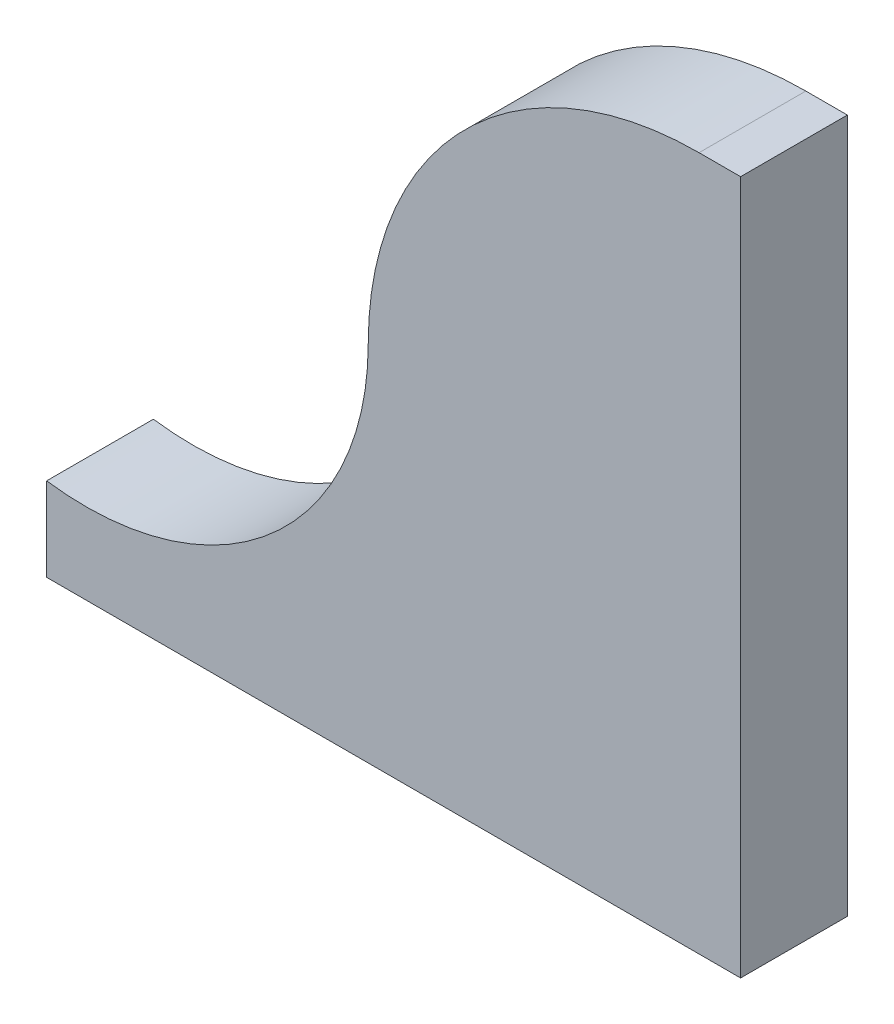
ISO-10303-21;
HEADER;
FILE_DESCRIPTION(('STEP AP214'),'2;1');
FILE_NAME('part.step','',(''),(''),'','','');
FILE_SCHEMA(('AUTOMOTIVE_DESIGN { 1 0 10303 214 1 1 1 1 }'));
ENDSEC;
DATA;
#1=APPLICATION_CONTEXT('core data for automotive mechanical design processes');
#2=APPLICATION_PROTOCOL_DEFINITION('international standard','automotive_design',2000,#1);
#3=PRODUCT_CONTEXT('',#1,'mechanical');
#4=PRODUCT('Part','Part','',(#3));
#5=PRODUCT_RELATED_PRODUCT_CATEGORY('part','',(#4));
#6=PRODUCT_DEFINITION_FORMATION('','',#4);
#7=PRODUCT_DEFINITION_CONTEXT('part definition',#1,'design');
#8=PRODUCT_DEFINITION('design','',#6,#7);
#9=PRODUCT_DEFINITION_SHAPE('','',#8);
#10=(LENGTH_UNIT() NAMED_UNIT(*) SI_UNIT(.MILLI.,.METRE.));
#11=(NAMED_UNIT(*) PLANE_ANGLE_UNIT() SI_UNIT($,.RADIAN.));
#12=(NAMED_UNIT(*) SI_UNIT($,.STERADIAN.) SOLID_ANGLE_UNIT());
#13=UNCERTAINTY_MEASURE_WITH_UNIT(LENGTH_MEASURE(1.E-05),#10,'distance_accuracy_value','');
#14=(GEOMETRIC_REPRESENTATION_CONTEXT(3) GLOBAL_UNCERTAINTY_ASSIGNED_CONTEXT((#13)) GLOBAL_UNIT_ASSIGNED_CONTEXT((#10,
#11,#12)) REPRESENTATION_CONTEXT('',''));
#15=CARTESIAN_POINT('',(0.,0.,0.));
#16=DIRECTION('',(0.,0.,1.));
#17=DIRECTION('',(1.,0.,0.));
#18=AXIS2_PLACEMENT_3D('',#15,#16,#17);
#19=CARTESIAN_POINT('',(-65.,0.,10.));
#20=DIRECTION('',(1.,0.,0.));
#21=DIRECTION('',(0.,0.,-1.));
#22=AXIS2_PLACEMENT_3D('',#19,#20,#21);
#23=PLANE('',#22);
#24=DIRECTION('',(0.,-1.,0.));
#25=VECTOR('',#24,1.);
#26=CARTESIAN_POINT('',(-65.,0.,0.));
#27=LINE('',#26,#25);
#28=CARTESIAN_POINT('',(-65.,7.82731434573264,0.));
#29=VERTEX_POINT('',#28);
#30=CARTESIAN_POINT('',(-65.,0.,0.));
#31=VERTEX_POINT('',#30);
#32=EDGE_CURVE('E118',#29,#31,#27,.T.);
#33=ORIENTED_EDGE('',*,*,#32,.T.);
#34=DIRECTION('',(0.,0.,-1.));
#35=VECTOR('',#34,1.);
#36=CARTESIAN_POINT('',(-65.,0.,10.));
#37=LINE('',#36,#35);
#38=CARTESIAN_POINT('',(-65.,0.,10.));
#39=VERTEX_POINT('',#38);
#40=EDGE_CURVE('E11',#39,#31,#37,.T.);
#41=ORIENTED_EDGE('',*,*,#40,.F.);
#42=DIRECTION('',(0.,-1.,0.));
#43=VECTOR('',#42,1.);
#44=CARTESIAN_POINT('',(-65.,0.,10.));
#45=LINE('',#44,#43);
#46=CARTESIAN_POINT('',(-65.,7.82731434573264,10.));
#47=VERTEX_POINT('',#46);
#48=EDGE_CURVE('E128',#47,#39,#45,.T.);
#49=ORIENTED_EDGE('',*,*,#48,.F.);
#50=DIRECTION('',(0.,0.,-1.));
#51=VECTOR('',#50,1.);
#52=CARTESIAN_POINT('',(-65.,7.82731434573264,10.));
#53=LINE('',#52,#51);
#54=EDGE_CURVE('E114',#47,#29,#53,.T.);
#55=ORIENTED_EDGE('',*,*,#54,.T.);
#56=EDGE_LOOP('',(#33,#41,#49,#55));
#57=FACE_BOUND('',#56,.T.);
#58=ADVANCED_FACE('F34',(#57),#23,.F.);
#59=CARTESIAN_POINT('',(-65.,0.,10.));
#60=DIRECTION('',(0.,1.,0.));
#61=DIRECTION('',(0.,0.,1.));
#62=AXIS2_PLACEMENT_3D('',#59,#60,#61);
#63=PLANE('',#62);
#64=DIRECTION('',(1.,0.,0.));
#65=VECTOR('',#64,1.);
#66=CARTESIAN_POINT('',(-65.,0.,0.));
#67=LINE('',#66,#65);
#68=CARTESIAN_POINT('',(0.,0.,0.));
#69=VERTEX_POINT('',#68);
#70=EDGE_CURVE('E121',#31,#69,#67,.T.);
#71=ORIENTED_EDGE('',*,*,#70,.T.);
#72=DIRECTION('',(0.,0.,-1.));
#73=VECTOR('',#72,1.);
#74=CARTESIAN_POINT('',(0.,0.,10.));
#75=LINE('',#74,#73);
#76=CARTESIAN_POINT('',(0.,0.,10.));
#77=VERTEX_POINT('',#76);
#78=EDGE_CURVE('E42',#77,#69,#75,.T.);
#79=ORIENTED_EDGE('',*,*,#78,.F.);
#80=DIRECTION('',(1.,0.,0.));
#81=VECTOR('',#80,1.);
#82=CARTESIAN_POINT('',(-65.,0.,10.));
#83=LINE('',#82,#81);
#84=EDGE_CURVE('E87',#39,#77,#83,.T.);
#85=ORIENTED_EDGE('',*,*,#84,.F.);
#86=ORIENTED_EDGE('',*,*,#40,.T.);
#87=EDGE_LOOP('',(#71,#79,#85,#86));
#88=FACE_BOUND('',#87,.T.);
#89=ADVANCED_FACE('F152',(#88),#63,.F.);
#90=CARTESIAN_POINT('',(0.,0.,10.));
#91=DIRECTION('',(-1.,0.,0.));
#92=DIRECTION('',(0.,0.,1.));
#93=AXIS2_PLACEMENT_3D('',#90,#91,#92);
#94=PLANE('',#93);
#95=DIRECTION('',(0.,1.,0.));
#96=VECTOR('',#95,1.);
#97=CARTESIAN_POINT('',(0.,0.,0.));
#98=LINE('',#97,#96);
#99=CARTESIAN_POINT('',(0.,65.,0.));
#100=VERTEX_POINT('',#99);
#101=EDGE_CURVE('E123',#69,#100,#98,.T.);
#102=ORIENTED_EDGE('',*,*,#101,.T.);
#103=DIRECTION('',(0.,0.,-1.));
#104=VECTOR('',#103,1.);
#105=CARTESIAN_POINT('',(0.,65.,10.));
#106=LINE('',#105,#104);
#107=CARTESIAN_POINT('',(0.,65.,10.));
#108=VERTEX_POINT('',#107);
#109=EDGE_CURVE('E109',#108,#100,#106,.T.);
#110=ORIENTED_EDGE('',*,*,#109,.F.);
#111=DIRECTION('',(0.,1.,0.));
#112=VECTOR('',#111,1.);
#113=CARTESIAN_POINT('',(0.,0.,10.));
#114=LINE('',#113,#112);
#115=EDGE_CURVE('E100',#77,#108,#114,.T.);
#116=ORIENTED_EDGE('',*,*,#115,.F.);
#117=ORIENTED_EDGE('',*,*,#78,.T.);
#118=EDGE_LOOP('',(#102,#110,#116,#117));
#119=FACE_BOUND('',#118,.T.);
#120=ADVANCED_FACE('F134',(#119),#94,.F.);
#121=CARTESIAN_POINT('',(0.,65.,10.));
#122=DIRECTION('',(0.,-1.,0.));
#123=DIRECTION('',(1.,0.,0.));
#124=AXIS2_PLACEMENT_3D('',#121,#122,#123);
#125=PLANE('',#124);
#126=DIRECTION('',(-1.,0.,0.));
#127=VECTOR('',#126,1.);
#128=CARTESIAN_POINT('',(0.,65.,0.));
#129=LINE('',#128,#127);
#130=CARTESIAN_POINT('',(-3.89190070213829,65.,0.));
#131=VERTEX_POINT('',#130);
#132=EDGE_CURVE('E108',#100,#131,#129,.T.);
#133=ORIENTED_EDGE('',*,*,#132,.T.);
#134=DIRECTION('',(0.,0.,-1.));
#135=VECTOR('',#134,1.);
#136=CARTESIAN_POINT('',(-3.89190070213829,65.,10.));
#137=LINE('',#136,#135);
#138=CARTESIAN_POINT('',(-3.89190070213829,65.,10.));
#139=VERTEX_POINT('',#138);
#140=EDGE_CURVE('E105',#139,#131,#137,.T.);
#141=ORIENTED_EDGE('',*,*,#140,.F.);
#142=DIRECTION('',(-1.,0.,0.));
#143=VECTOR('',#142,1.);
#144=CARTESIAN_POINT('',(0.,65.,10.));
#145=LINE('',#144,#143);
#146=EDGE_CURVE('E94',#108,#139,#145,.T.);
#147=ORIENTED_EDGE('',*,*,#146,.F.);
#148=ORIENTED_EDGE('',*,*,#109,.T.);
#149=EDGE_LOOP('',(#133,#141,#147,#148));
#150=FACE_BOUND('',#149,.T.);
#151=ADVANCED_FACE('F106',(#150),#125,.F.);
#152=CARTESIAN_POINT('',(-3.89190070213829,34.0146422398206,10.));
#153=DIRECTION('',(0.,0.,-1.));
#154=DIRECTION('',(-1.,0.,0.));
#155=AXIS2_PLACEMENT_3D('',#152,#153,#154);
#156=CYLINDRICAL_SURFACE('',#155,30.9853577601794);
#157=CARTESIAN_POINT('',(-3.89190070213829,34.0146422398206,0.));
#158=DIRECTION('',(0.,0.,1.));
#159=DIRECTION('',(1.,0.,0.));
#160=AXIS2_PLACEMENT_3D('',#157,#158,#159);
#161=CIRCLE('',#160,30.9853577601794);
#162=CARTESIAN_POINT('',(-34.8772584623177,34.0146422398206,0.));
#163=VERTEX_POINT('',#162);
#164=EDGE_CURVE('E73',#131,#163,#161,.T.);
#165=ORIENTED_EDGE('',*,*,#164,.T.);
#166=DIRECTION('',(0.,0.,-1.));
#167=VECTOR('',#166,1.);
#168=CARTESIAN_POINT('',(-34.8772584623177,34.0146422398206,10.));
#169=LINE('',#168,#167);
#170=CARTESIAN_POINT('',(-34.8772584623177,34.0146422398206,10.));
#171=VERTEX_POINT('',#170);
#172=EDGE_CURVE('E110',#171,#163,#169,.T.);
#173=ORIENTED_EDGE('',*,*,#172,.F.);
#174=CARTESIAN_POINT('',(-3.89190070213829,34.0146422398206,10.));
#175=DIRECTION('',(0.,0.,1.));
#176=DIRECTION('',(1.,0.,0.));
#177=AXIS2_PLACEMENT_3D('',#174,#175,#176);
#178=CIRCLE('',#177,30.9853577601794);
#179=EDGE_CURVE('E98',#139,#171,#178,.T.);
#180=ORIENTED_EDGE('',*,*,#179,.F.);
#181=ORIENTED_EDGE('',*,*,#140,.T.);
#182=EDGE_LOOP('',(#165,#173,#180,#181));
#183=FACE_BOUND('',#182,.T.);
#184=ADVANCED_FACE('F112',(#183),#156,.T.);
#185=CARTESIAN_POINT('',(-61.321659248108,34.0146422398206,10.));
#186=DIRECTION('',(0.,0.,-1.));
#187=DIRECTION('',(-1.,0.,0.));
#188=AXIS2_PLACEMENT_3D('',#185,#186,#187);
#189=CYLINDRICAL_SURFACE('',#188,26.4444007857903);
#190=CARTESIAN_POINT('',(-61.321659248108,34.0146422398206,0.));
#191=DIRECTION('',(0.,0.,-1.));
#192=DIRECTION('',(1.,0.,0.));
#193=AXIS2_PLACEMENT_3D('',#190,#191,#192);
#194=CIRCLE('',#193,26.4444007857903);
#195=EDGE_CURVE('E79',#163,#29,#194,.T.);
#196=ORIENTED_EDGE('',*,*,#195,.T.);
#197=ORIENTED_EDGE('',*,*,#54,.F.);
#198=CARTESIAN_POINT('',(-61.321659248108,34.0146422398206,10.));
#199=DIRECTION('',(0.,0.,-1.));
#200=DIRECTION('',(1.,0.,0.));
#201=AXIS2_PLACEMENT_3D('',#198,#199,#200);
#202=CIRCLE('',#201,26.4444007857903);
#203=EDGE_CURVE('E50',#171,#47,#202,.T.);
#204=ORIENTED_EDGE('',*,*,#203,.F.);
#205=ORIENTED_EDGE('',*,*,#172,.T.);
#206=EDGE_LOOP('',(#196,#197,#204,#205));
#207=FACE_BOUND('',#206,.T.);
#208=ADVANCED_FACE('F141',(#207),#189,.F.);
#209=CARTESIAN_POINT('',(-61.321659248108,34.0146422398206,10.));
#210=DIRECTION('',(0.,0.,1.));
#211=DIRECTION('',(1.,0.,0.));
#212=AXIS2_PLACEMENT_3D('',#209,#210,#211);
#213=PLANE('',#212);
#214=ORIENTED_EDGE('',*,*,#48,.T.);
#215=ORIENTED_EDGE('',*,*,#84,.T.);
#216=ORIENTED_EDGE('',*,*,#115,.T.);
#217=ORIENTED_EDGE('',*,*,#146,.T.);
#218=ORIENTED_EDGE('',*,*,#179,.T.);
#219=ORIENTED_EDGE('',*,*,#203,.T.);
#220=EDGE_LOOP('',(#214,#215,#216,#217,#218,#219));
#221=FACE_BOUND('',#220,.T.);
#222=ADVANCED_FACE('F96',(#221),#213,.T.);
#223=CARTESIAN_POINT('',(-61.321659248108,34.0146422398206,0.));
#224=DIRECTION('',(0.,0.,1.));
#225=DIRECTION('',(1.,0.,0.));
#226=AXIS2_PLACEMENT_3D('',#223,#224,#225);
#227=PLANE('',#226);
#228=ORIENTED_EDGE('',*,*,#32,.F.);
#229=ORIENTED_EDGE('',*,*,#195,.F.);
#230=ORIENTED_EDGE('',*,*,#164,.F.);
#231=ORIENTED_EDGE('',*,*,#132,.F.);
#232=ORIENTED_EDGE('',*,*,#101,.F.);
#233=ORIENTED_EDGE('',*,*,#70,.F.);
#234=EDGE_LOOP('',(#228,#229,#230,#231,#232,#233));
#235=FACE_BOUND('',#234,.T.);
#236=ADVANCED_FACE('F137',(#235),#227,.F.);
#237=CLOSED_SHELL('',(#58,#89,#120,#151,#184,#208,#222,#236));
#238=MANIFOLD_SOLID_BREP('B2',#237);
#239=ADVANCED_BREP_SHAPE_REPRESENTATION('',(#18,#238),#14);
#240=SHAPE_DEFINITION_REPRESENTATION(#9,#239);
ENDSEC;
END-ISO-10303-21;
